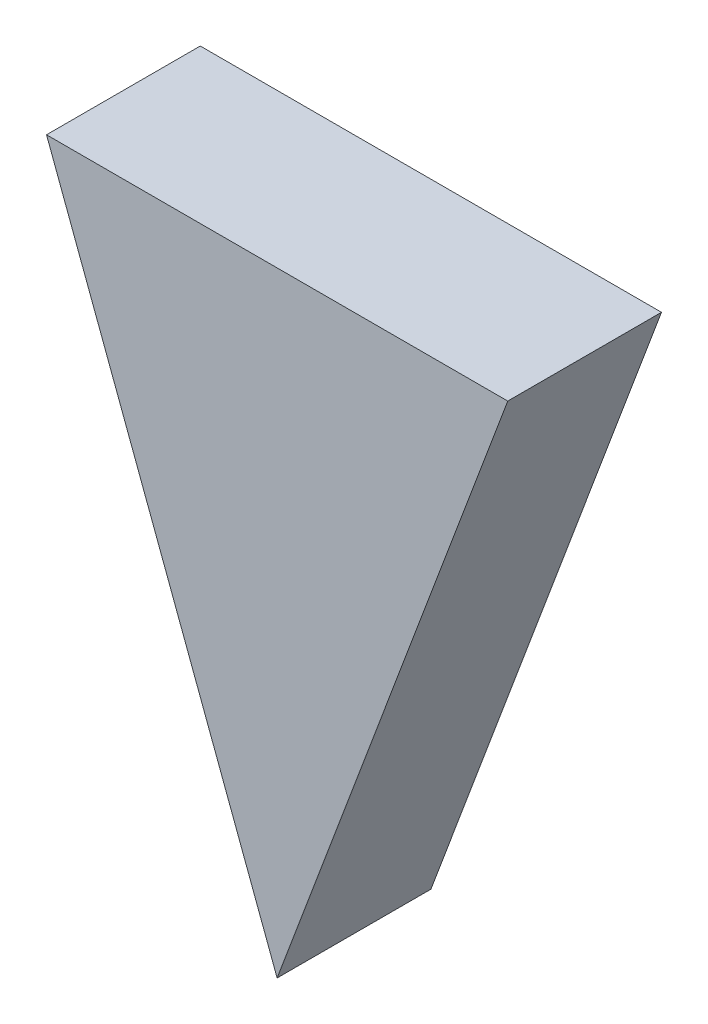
ISO-10303-21;
HEADER;
FILE_DESCRIPTION(('STEP AP214'),'2;1');
FILE_NAME('part.step','',(''),(''),'','','');
FILE_SCHEMA(('AUTOMOTIVE_DESIGN { 1 0 10303 214 1 1 1 1 }'));
ENDSEC;
DATA;
#1=APPLICATION_CONTEXT('core data for automotive mechanical design processes');
#2=APPLICATION_PROTOCOL_DEFINITION('international standard','automotive_design',2000,#1);
#3=PRODUCT_CONTEXT('',#1,'mechanical');
#4=PRODUCT('Part','Part','',(#3));
#5=PRODUCT_RELATED_PRODUCT_CATEGORY('part','',(#4));
#6=PRODUCT_DEFINITION_FORMATION('','',#4);
#7=PRODUCT_DEFINITION_CONTEXT('part definition',#1,'design');
#8=PRODUCT_DEFINITION('design','',#6,#7);
#9=PRODUCT_DEFINITION_SHAPE('','',#8);
#10=(LENGTH_UNIT() NAMED_UNIT(*) SI_UNIT(.MILLI.,.METRE.));
#11=(NAMED_UNIT(*) PLANE_ANGLE_UNIT() SI_UNIT($,.RADIAN.));
#12=(NAMED_UNIT(*) SI_UNIT($,.STERADIAN.) SOLID_ANGLE_UNIT());
#13=UNCERTAINTY_MEASURE_WITH_UNIT(LENGTH_MEASURE(1.E-05),#10,'distance_accuracy_value','');
#14=(GEOMETRIC_REPRESENTATION_CONTEXT(3) GLOBAL_UNCERTAINTY_ASSIGNED_CONTEXT((#13)) GLOBAL_UNIT_ASSIGNED_CONTEXT((#10,
#11,#12)) REPRESENTATION_CONTEXT('',''));
#15=CARTESIAN_POINT('',(0.,0.,0.));
#16=DIRECTION('',(0.,0.,1.));
#17=DIRECTION('',(1.,0.,0.));
#18=AXIS2_PLACEMENT_3D('',#15,#16,#17);
#19=CARTESIAN_POINT('',(15.,40.,10.));
#20=DIRECTION('',(-0.936329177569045,0.351123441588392,0.));
#21=DIRECTION('',(-0.351123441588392,-0.936329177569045,0.));
#22=AXIS2_PLACEMENT_3D('',#19,#20,#21);
#23=PLANE('',#22);
#24=DIRECTION('',(0.351123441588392,0.936329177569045,0.));
#25=VECTOR('',#24,1.);
#26=CARTESIAN_POINT('',(15.,40.,0.));
#27=LINE('',#26,#25);
#28=CARTESIAN_POINT('',(0.,0.,0.));
#29=VERTEX_POINT('',#28);
#30=CARTESIAN_POINT('',(15.,40.,0.));
#31=VERTEX_POINT('',#30);
#32=EDGE_CURVE('E80',#29,#31,#27,.T.);
#33=ORIENTED_EDGE('',*,*,#32,.T.);
#34=DIRECTION('',(0.,0.,-1.));
#35=VECTOR('',#34,1.);
#36=CARTESIAN_POINT('',(15.,40.,10.));
#37=LINE('',#36,#35);
#38=CARTESIAN_POINT('',(15.,40.,10.));
#39=VERTEX_POINT('',#38);
#40=EDGE_CURVE('E11',#39,#31,#37,.T.);
#41=ORIENTED_EDGE('',*,*,#40,.F.);
#42=DIRECTION('',(0.351123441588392,0.936329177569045,0.));
#43=VECTOR('',#42,1.);
#44=CARTESIAN_POINT('',(15.,40.,10.));
#45=LINE('',#44,#43);
#46=CARTESIAN_POINT('',(0.,0.,10.));
#47=VERTEX_POINT('',#46);
#48=EDGE_CURVE('E73',#47,#39,#45,.T.);
#49=ORIENTED_EDGE('',*,*,#48,.F.);
#50=DIRECTION('',(0.,0.,-1.));
#51=VECTOR('',#50,1.);
#52=CARTESIAN_POINT('',(0.,0.,10.));
#53=LINE('',#52,#51);
#54=EDGE_CURVE('E81',#47,#29,#53,.T.);
#55=ORIENTED_EDGE('',*,*,#54,.T.);
#56=EDGE_LOOP('',(#33,#41,#49,#55));
#57=FACE_BOUND('',#56,.T.);
#58=ADVANCED_FACE('F33',(#57),#23,.F.);
#59=CARTESIAN_POINT('',(-15.,40.,10.));
#60=DIRECTION('',(0.,-1.,0.));
#61=DIRECTION('',(0.,0.,-1.));
#62=AXIS2_PLACEMENT_3D('',#59,#60,#61);
#63=PLANE('',#62);
#64=DIRECTION('',(-1.,0.,0.));
#65=VECTOR('',#64,1.);
#66=CARTESIAN_POINT('',(-15.,40.,0.));
#67=LINE('',#66,#65);
#68=CARTESIAN_POINT('',(-15.,40.,0.));
#69=VERTEX_POINT('',#68);
#70=EDGE_CURVE('E61',#31,#69,#67,.T.);
#71=ORIENTED_EDGE('',*,*,#70,.T.);
#72=DIRECTION('',(0.,0.,-1.));
#73=VECTOR('',#72,1.);
#74=CARTESIAN_POINT('',(-15.,40.,10.));
#75=LINE('',#74,#73);
#76=CARTESIAN_POINT('',(-15.,40.,10.));
#77=VERTEX_POINT('',#76);
#78=EDGE_CURVE('E41',#77,#69,#75,.T.);
#79=ORIENTED_EDGE('',*,*,#78,.F.);
#80=DIRECTION('',(-1.,0.,0.));
#81=VECTOR('',#80,1.);
#82=CARTESIAN_POINT('',(-15.,40.,10.));
#83=LINE('',#82,#81);
#84=EDGE_CURVE('E69',#39,#77,#83,.T.);
#85=ORIENTED_EDGE('',*,*,#84,.F.);
#86=ORIENTED_EDGE('',*,*,#40,.T.);
#87=EDGE_LOOP('',(#71,#79,#85,#86));
#88=FACE_BOUND('',#87,.T.);
#89=ADVANCED_FACE('F70',(#88),#63,.F.);
#90=CARTESIAN_POINT('',(0.,0.,10.));
#91=DIRECTION('',(0.936329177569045,0.351123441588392,0.));
#92=DIRECTION('',(-0.351123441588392,0.936329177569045,0.));
#93=AXIS2_PLACEMENT_3D('',#90,#91,#92);
#94=PLANE('',#93);
#95=DIRECTION('',(0.351123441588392,-0.936329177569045,0.));
#96=VECTOR('',#95,1.);
#97=CARTESIAN_POINT('',(0.,0.,0.));
#98=LINE('',#97,#96);
#99=EDGE_CURVE('E66',#69,#29,#98,.T.);
#100=ORIENTED_EDGE('',*,*,#99,.T.);
#101=ORIENTED_EDGE('',*,*,#54,.F.);
#102=DIRECTION('',(0.351123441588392,-0.936329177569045,0.));
#103=VECTOR('',#102,1.);
#104=CARTESIAN_POINT('',(0.,0.,10.));
#105=LINE('',#104,#103);
#106=EDGE_CURVE('E49',#77,#47,#105,.T.);
#107=ORIENTED_EDGE('',*,*,#106,.F.);
#108=ORIENTED_EDGE('',*,*,#78,.T.);
#109=EDGE_LOOP('',(#100,#101,#107,#108));
#110=FACE_BOUND('',#109,.T.);
#111=ADVANCED_FACE('F88',(#110),#94,.F.);
#112=CARTESIAN_POINT('',(0.,0.,10.));
#113=DIRECTION('',(0.,0.,1.));
#114=DIRECTION('',(1.,0.,0.));
#115=AXIS2_PLACEMENT_3D('',#112,#113,#114);
#116=PLANE('',#115);
#117=ORIENTED_EDGE('',*,*,#48,.T.);
#118=ORIENTED_EDGE('',*,*,#84,.T.);
#119=ORIENTED_EDGE('',*,*,#106,.T.);
#120=EDGE_LOOP('',(#117,#118,#119));
#121=FACE_BOUND('',#120,.T.);
#122=ADVANCED_FACE('F76',(#121),#116,.T.);
#123=CARTESIAN_POINT('',(0.,0.,0.));
#124=DIRECTION('',(0.,0.,1.));
#125=DIRECTION('',(1.,0.,0.));
#126=AXIS2_PLACEMENT_3D('',#123,#124,#125);
#127=PLANE('',#126);
#128=ORIENTED_EDGE('',*,*,#32,.F.);
#129=ORIENTED_EDGE('',*,*,#99,.F.);
#130=ORIENTED_EDGE('',*,*,#70,.F.);
#131=EDGE_LOOP('',(#128,#129,#130));
#132=FACE_BOUND('',#131,.T.);
#133=ADVANCED_FACE('F89',(#132),#127,.F.);
#134=CLOSED_SHELL('',(#58,#89,#111,#122,#133));
#135=MANIFOLD_SOLID_BREP('B2',#134);
#136=ADVANCED_BREP_SHAPE_REPRESENTATION('',(#18,#135),#14);
#137=SHAPE_DEFINITION_REPRESENTATION(#9,#136);
ENDSEC;
END-ISO-10303-21;
